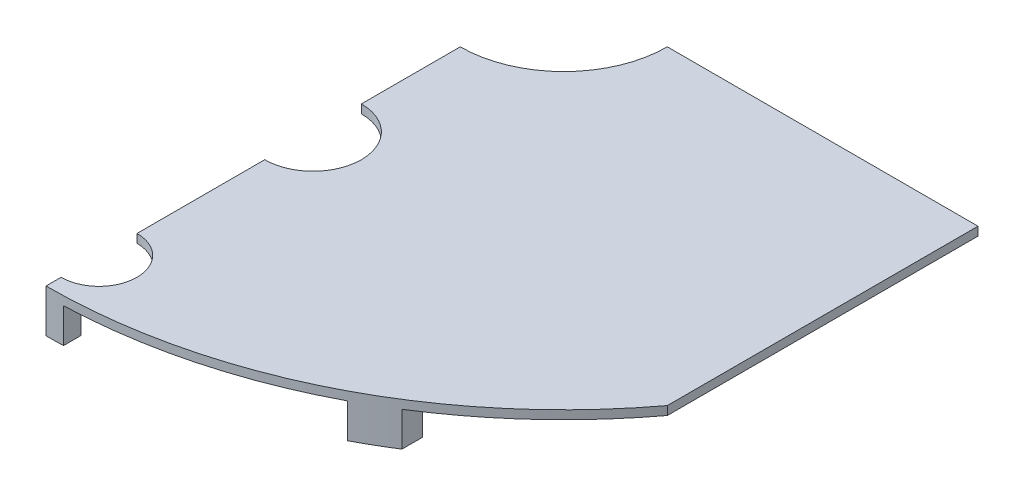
ISO-10303-21;
HEADER;
FILE_DESCRIPTION(('STEP AP214'),'2;1');
FILE_NAME('part.step','',(''),(''),'','','');
FILE_SCHEMA(('AUTOMOTIVE_DESIGN { 1 0 10303 214 1 1 1 1 }'));
ENDSEC;
DATA;
#1=APPLICATION_CONTEXT('core data for automotive mechanical design processes');
#2=APPLICATION_PROTOCOL_DEFINITION('international standard','automotive_design',2000,#1);
#3=PRODUCT_CONTEXT('',#1,'mechanical');
#4=PRODUCT('Part','Part','',(#3));
#5=PRODUCT_RELATED_PRODUCT_CATEGORY('part','',(#4));
#6=PRODUCT_DEFINITION_FORMATION('','',#4);
#7=PRODUCT_DEFINITION_CONTEXT('part definition',#1,'design');
#8=PRODUCT_DEFINITION('design','',#6,#7);
#9=PRODUCT_DEFINITION_SHAPE('','',#8);
#10=(LENGTH_UNIT() NAMED_UNIT(*) SI_UNIT(.MILLI.,.METRE.));
#11=(NAMED_UNIT(*) PLANE_ANGLE_UNIT() SI_UNIT($,.RADIAN.));
#12=(NAMED_UNIT(*) SI_UNIT($,.STERADIAN.) SOLID_ANGLE_UNIT());
#13=UNCERTAINTY_MEASURE_WITH_UNIT(LENGTH_MEASURE(1.E-05),#10,'distance_accuracy_value','');
#14=(GEOMETRIC_REPRESENTATION_CONTEXT(3) GLOBAL_UNCERTAINTY_ASSIGNED_CONTEXT((#13)) GLOBAL_UNIT_ASSIGNED_CONTEXT((#10,
#11,#12)) REPRESENTATION_CONTEXT('',''));
#15=CARTESIAN_POINT('',(0.,0.,0.));
#16=DIRECTION('',(0.,0.,1.));
#17=DIRECTION('',(1.,0.,0.));
#18=AXIS2_PLACEMENT_3D('',#15,#16,#17);
#19=CARTESIAN_POINT('',(0.,0.,0.));
#20=DIRECTION('',(0.,1.,0.));
#21=DIRECTION('',(0.,0.,1.));
#22=AXIS2_PLACEMENT_3D('',#19,#20,#21);
#23=PLANE('',#22);
#24=DIRECTION('',(1.,0.,0.));
#25=VECTOR('',#24,1.);
#26=CARTESIAN_POINT('',(0.,0.,0.));
#27=LINE('',#26,#25);
#28=CARTESIAN_POINT('',(30.,0.,0.));
#29=VERTEX_POINT('',#28);
#30=CARTESIAN_POINT('',(120.,0.,1.61653377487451E-13));
#31=VERTEX_POINT('',#30);
#32=EDGE_CURVE('E175',#29,#31,#27,.T.);
#33=ORIENTED_EDGE('',*,*,#32,.T.);
#34=DIRECTION('',(0.,0.,1.));
#35=VECTOR('',#34,1.);
#36=CARTESIAN_POINT('',(120.,0.,0.));
#37=LINE('',#36,#35);
#38=CARTESIAN_POINT('',(120.,0.,89.9999999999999));
#39=VERTEX_POINT('',#38);
#40=EDGE_CURVE('E164',#31,#39,#37,.T.);
#41=ORIENTED_EDGE('',*,*,#40,.T.);
#42=CARTESIAN_POINT('',(0.,0.,0.));
#43=DIRECTION('',(0.,1.,0.));
#44=DIRECTION('',(0.,0.,1.));
#45=AXIS2_PLACEMENT_3D('',#42,#43,#44);
#46=CIRCLE('',#45,150.);
#47=CARTESIAN_POINT('',(80.,0.,126.885775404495));
#48=VERTEX_POINT('',#47);
#49=EDGE_CURVE('E163',#48,#39,#46,.T.);
#50=ORIENTED_EDGE('',*,*,#49,.F.);
#51=DIRECTION('',(0.,0.,1.));
#52=VECTOR('',#51,1.);
#53=CARTESIAN_POINT('',(80.,0.,0.));
#54=LINE('',#53,#52);
#55=CARTESIAN_POINT('',(80.,0.,120.933866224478));
#56=VERTEX_POINT('',#55);
#57=EDGE_CURVE('E236',#56,#48,#54,.T.);
#58=ORIENTED_EDGE('',*,*,#57,.F.);
#59=CARTESIAN_POINT('',(0.,0.,0.));
#60=DIRECTION('',(0.,-1.,0.));
#61=DIRECTION('',(0.,0.,-1.));
#62=AXIS2_PLACEMENT_3D('',#59,#60,#61);
#63=CIRCLE('',#62,145.);
#64=CARTESIAN_POINT('',(70.,0.,126.984250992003));
#65=VERTEX_POINT('',#64);
#66=EDGE_CURVE('E217',#56,#65,#63,.T.);
#67=ORIENTED_EDGE('',*,*,#66,.T.);
#68=DIRECTION('',(0.,0.,1.));
#69=VECTOR('',#68,1.);
#70=CARTESIAN_POINT('',(70.,0.,0.));
#71=LINE('',#70,#69);
#72=CARTESIAN_POINT('',(70.,0.,132.664991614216));
#73=VERTEX_POINT('',#72);
#74=EDGE_CURVE('E226',#65,#73,#71,.T.);
#75=ORIENTED_EDGE('',*,*,#74,.T.);
#76=CARTESIAN_POINT('',(5.,0.,149.916643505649));
#77=VERTEX_POINT('',#76);
#78=EDGE_CURVE('E188',#77,#73,#46,.T.);
#79=ORIENTED_EDGE('',*,*,#78,.F.);
#80=DIRECTION('',(0.,0.,1.));
#81=VECTOR('',#80,1.);
#82=CARTESIAN_POINT('',(5.,0.,0.));
#83=LINE('',#82,#81);
#84=CARTESIAN_POINT('',(5.,0.,144.913767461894));
#85=VERTEX_POINT('',#84);
#86=EDGE_CURVE('E252',#85,#77,#83,.T.);
#87=ORIENTED_EDGE('',*,*,#86,.F.);
#88=CARTESIAN_POINT('',(0.,0.,0.));
#89=DIRECTION('',(0.,-1.,0.));
#90=DIRECTION('',(0.,0.,-1.));
#91=AXIS2_PLACEMENT_3D('',#88,#89,#90);
#92=CIRCLE('',#91,145.);
#93=CARTESIAN_POINT('',(3.8383223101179,0.,144.949188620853));
#94=VERTEX_POINT('',#93);
#95=EDGE_CURVE('E247',#85,#94,#92,.T.);
#96=ORIENTED_EDGE('',*,*,#95,.T.);
#97=CARTESIAN_POINT('',(0.,0.,134.640586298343));
#98=DIRECTION('',(0.,1.,0.));
#99=DIRECTION('',(0.,0.,1.));
#100=AXIS2_PLACEMENT_3D('',#97,#98,#99);
#101=CIRCLE('',#100,11.);
#102=CARTESIAN_POINT('',(0.,0.,123.640586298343));
#103=VERTEX_POINT('',#102);
#104=EDGE_CURVE('E181',#94,#103,#101,.T.);
#105=ORIENTED_EDGE('',*,*,#104,.T.);
#106=DIRECTION('',(0.,0.,-1.));
#107=VECTOR('',#106,1.);
#108=CARTESIAN_POINT('',(0.,0.,0.));
#109=LINE('',#108,#107);
#110=CARTESIAN_POINT('',(0.,0.,86.6405862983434));
#111=VERTEX_POINT('',#110);
#112=EDGE_CURVE('E284',#103,#111,#109,.T.);
#113=ORIENTED_EDGE('',*,*,#112,.T.);
#114=CARTESIAN_POINT('',(0.,0.,72.6405862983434));
#115=DIRECTION('',(0.,1.,0.));
#116=DIRECTION('',(0.,0.,1.));
#117=AXIS2_PLACEMENT_3D('',#114,#115,#116);
#118=CIRCLE('',#117,14.);
#119=CARTESIAN_POINT('',(0.,0.,58.6405862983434));
#120=VERTEX_POINT('',#119);
#121=EDGE_CURVE('E206',#111,#120,#118,.T.);
#122=ORIENTED_EDGE('',*,*,#121,.T.);
#123=CARTESIAN_POINT('',(0.,0.,30.));
#124=VERTEX_POINT('',#123);
#125=EDGE_CURVE('E282',#120,#124,#109,.T.);
#126=ORIENTED_EDGE('',*,*,#125,.T.);
#127=CARTESIAN_POINT('',(0.,0.,0.));
#128=DIRECTION('',(0.,1.,0.));
#129=DIRECTION('',(0.,0.,1.));
#130=AXIS2_PLACEMENT_3D('',#127,#128,#129);
#131=CIRCLE('',#130,30.);
#132=EDGE_CURVE('E179',#124,#29,#131,.T.);
#133=ORIENTED_EDGE('',*,*,#132,.T.);
#134=EDGE_LOOP('',(#33,#41,#50,#58,#67,#75,#79,#87,#96,#105,#113,#122,#126,#133));
#135=FACE_BOUND('',#134,.T.);
#136=ADVANCED_FACE('F35',(#135),#23,.F.);
#137=CARTESIAN_POINT('',(0.,2.5,0.));
#138=DIRECTION('',(0.,-1.,0.));
#139=DIRECTION('',(0.,0.,-1.));
#140=AXIS2_PLACEMENT_3D('',#137,#138,#139);
#141=CYLINDRICAL_SURFACE('',#140,30.);
#142=DIRECTION('',(0.,-1.,0.));
#143=VECTOR('',#142,1.);
#144=CARTESIAN_POINT('',(0.,2.5,30.));
#145=LINE('',#144,#143);
#146=CARTESIAN_POINT('',(0.,2.5,30.));
#147=VERTEX_POINT('',#146);
#148=EDGE_CURVE('E278',#147,#124,#145,.T.);
#149=ORIENTED_EDGE('',*,*,#148,.F.);
#150=CARTESIAN_POINT('',(0.,2.5,0.));
#151=DIRECTION('',(0.,1.,0.));
#152=DIRECTION('',(0.,0.,1.));
#153=AXIS2_PLACEMENT_3D('',#150,#151,#152);
#154=CIRCLE('',#153,30.);
#155=CARTESIAN_POINT('',(30.,2.5,0.));
#156=VERTEX_POINT('',#155);
#157=EDGE_CURVE('E171',#147,#156,#154,.T.);
#158=ORIENTED_EDGE('',*,*,#157,.T.);
#159=DIRECTION('',(0.,-1.,0.));
#160=VECTOR('',#159,1.);
#161=CARTESIAN_POINT('',(30.,2.5,0.));
#162=LINE('',#161,#160);
#163=EDGE_CURVE('E173',#156,#29,#162,.T.);
#164=ORIENTED_EDGE('',*,*,#163,.T.);
#165=ORIENTED_EDGE('',*,*,#132,.F.);
#166=EDGE_LOOP('',(#149,#158,#164,#165));
#167=FACE_BOUND('',#166,.T.);
#168=ADVANCED_FACE('F37',(#167),#141,.F.);
#169=CARTESIAN_POINT('',(0.,2.5,0.));
#170=DIRECTION('',(0.,-1.,0.));
#171=DIRECTION('',(0.,0.,-1.));
#172=AXIS2_PLACEMENT_3D('',#169,#170,#171);
#173=CYLINDRICAL_SURFACE('',#172,150.);
#174=ORIENTED_EDGE('',*,*,#49,.T.);
#175=DIRECTION('',(0.,1.,0.));
#176=VECTOR('',#175,1.);
#177=CARTESIAN_POINT('',(120.,-156.5,89.9999999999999));
#178=LINE('',#177,#176);
#179=CARTESIAN_POINT('',(120.,2.5,89.9999999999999));
#180=VERTEX_POINT('',#179);
#181=EDGE_CURVE('E148',#39,#180,#178,.T.);
#182=ORIENTED_EDGE('',*,*,#181,.T.);
#183=CARTESIAN_POINT('',(0.,2.5,0.));
#184=DIRECTION('',(0.,1.,0.));
#185=DIRECTION('',(0.,0.,1.));
#186=AXIS2_PLACEMENT_3D('',#183,#184,#185);
#187=CIRCLE('',#186,150.);
#188=CARTESIAN_POINT('',(0.,2.5,150.));
#189=VERTEX_POINT('',#188);
#190=EDGE_CURVE('E160',#189,#180,#187,.T.);
#191=ORIENTED_EDGE('',*,*,#190,.F.);
#192=DIRECTION('',(0.,-1.,0.));
#193=VECTOR('',#192,1.);
#194=CARTESIAN_POINT('',(0.,2.5,150.));
#195=LINE('',#194,#193);
#196=CARTESIAN_POINT('',(0.,-10.,150.));
#197=VERTEX_POINT('',#196);
#198=EDGE_CURVE('E215',#189,#197,#195,.T.);
#199=ORIENTED_EDGE('',*,*,#198,.T.);
#200=CARTESIAN_POINT('',(0.,-10.,0.));
#201=DIRECTION('',(0.,-1.,0.));
#202=DIRECTION('',(0.,0.,-1.));
#203=AXIS2_PLACEMENT_3D('',#200,#201,#202);
#204=CIRCLE('',#203,150.);
#205=CARTESIAN_POINT('',(5.,-10.,149.916643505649));
#206=VERTEX_POINT('',#205);
#207=EDGE_CURVE('E254',#206,#197,#204,.T.);
#208=ORIENTED_EDGE('',*,*,#207,.F.);
#209=DIRECTION('',(0.,1.,0.));
#210=VECTOR('',#209,1.);
#211=CARTESIAN_POINT('',(5.,-10.,149.916643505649));
#212=LINE('',#211,#210);
#213=EDGE_CURVE('E266',#206,#77,#212,.T.);
#214=ORIENTED_EDGE('',*,*,#213,.T.);
#215=ORIENTED_EDGE('',*,*,#78,.T.);
#216=DIRECTION('',(0.,1.,0.));
#217=VECTOR('',#216,1.);
#218=CARTESIAN_POINT('',(70.,-10.,132.664991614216));
#219=LINE('',#218,#217);
#220=CARTESIAN_POINT('',(70.,-10.,132.664991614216));
#221=VERTEX_POINT('',#220);
#222=EDGE_CURVE('E241',#221,#73,#219,.T.);
#223=ORIENTED_EDGE('',*,*,#222,.F.);
#224=CARTESIAN_POINT('',(0.,-10.,0.));
#225=DIRECTION('',(0.,-1.,0.));
#226=DIRECTION('',(0.,0.,-1.));
#227=AXIS2_PLACEMENT_3D('',#224,#225,#226);
#228=CIRCLE('',#227,150.);
#229=CARTESIAN_POINT('',(80.,-10.,126.885775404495));
#230=VERTEX_POINT('',#229);
#231=EDGE_CURVE('E228',#230,#221,#228,.T.);
#232=ORIENTED_EDGE('',*,*,#231,.F.);
#233=DIRECTION('',(0.,1.,0.));
#234=VECTOR('',#233,1.);
#235=CARTESIAN_POINT('',(80.,-10.,126.885775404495));
#236=LINE('',#235,#234);
#237=EDGE_CURVE('E243',#230,#48,#236,.T.);
#238=ORIENTED_EDGE('',*,*,#237,.T.);
#239=EDGE_LOOP('',(#174,#182,#191,#199,#208,#214,#215,#223,#232,#238));
#240=FACE_BOUND('',#239,.T.);
#241=ADVANCED_FACE('F158',(#240),#173,.T.);
#242=CARTESIAN_POINT('',(0.,2.5,0.));
#243=DIRECTION('',(0.,0.,-1.));
#244=DIRECTION('',(-1.,0.,0.));
#245=AXIS2_PLACEMENT_3D('',#242,#243,#244);
#246=PLANE('',#245);
#247=DIRECTION('',(0.,1.,0.));
#248=VECTOR('',#247,1.);
#249=CARTESIAN_POINT('',(120.,-156.5,1.61653377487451E-13));
#250=LINE('',#249,#248);
#251=CARTESIAN_POINT('',(120.,2.5,1.61653377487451E-13));
#252=VERTEX_POINT('',#251);
#253=EDGE_CURVE('E50',#31,#252,#250,.T.);
#254=ORIENTED_EDGE('',*,*,#253,.F.);
#255=ORIENTED_EDGE('',*,*,#32,.F.);
#256=ORIENTED_EDGE('',*,*,#163,.F.);
#257=DIRECTION('',(1.,0.,0.));
#258=VECTOR('',#257,1.);
#259=CARTESIAN_POINT('',(0.,2.5,0.));
#260=LINE('',#259,#258);
#261=EDGE_CURVE('E170',#156,#252,#260,.T.);
#262=ORIENTED_EDGE('',*,*,#261,.T.);
#263=EDGE_LOOP('',(#254,#255,#256,#262));
#264=FACE_BOUND('',#263,.T.);
#265=ADVANCED_FACE('F292',(#264),#246,.T.);
#266=CARTESIAN_POINT('',(0.,2.5,0.));
#267=DIRECTION('',(0.,1.,0.));
#268=DIRECTION('',(0.,0.,1.));
#269=AXIS2_PLACEMENT_3D('',#266,#267,#268);
#270=PLANE('',#269);
#271=DIRECTION('',(0.,0.,1.));
#272=VECTOR('',#271,1.);
#273=CARTESIAN_POINT('',(120.,2.5,0.));
#274=LINE('',#273,#272);
#275=EDGE_CURVE('E145',#252,#180,#274,.T.);
#276=ORIENTED_EDGE('',*,*,#275,.F.);
#277=ORIENTED_EDGE('',*,*,#261,.F.);
#278=ORIENTED_EDGE('',*,*,#157,.F.);
#279=DIRECTION('',(0.,0.,-1.));
#280=VECTOR('',#279,1.);
#281=CARTESIAN_POINT('',(0.,2.5,0.));
#282=LINE('',#281,#280);
#283=CARTESIAN_POINT('',(0.,2.5,58.6405862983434));
#284=VERTEX_POINT('',#283);
#285=EDGE_CURVE('E214',#284,#147,#282,.T.);
#286=ORIENTED_EDGE('',*,*,#285,.F.);
#287=CARTESIAN_POINT('',(0.,2.5,72.6405862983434));
#288=DIRECTION('',(0.,1.,0.));
#289=DIRECTION('',(0.,0.,1.));
#290=AXIS2_PLACEMENT_3D('',#287,#288,#289);
#291=CIRCLE('',#290,14.);
#292=CARTESIAN_POINT('',(0.,2.5,86.6405862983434));
#293=VERTEX_POINT('',#292);
#294=EDGE_CURVE('E204',#293,#284,#291,.T.);
#295=ORIENTED_EDGE('',*,*,#294,.F.);
#296=CARTESIAN_POINT('',(0.,2.5,123.640586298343));
#297=VERTEX_POINT('',#296);
#298=EDGE_CURVE('E211',#297,#293,#282,.T.);
#299=ORIENTED_EDGE('',*,*,#298,.F.);
#300=CARTESIAN_POINT('',(0.,2.5,134.640586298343));
#301=DIRECTION('',(0.,1.,0.));
#302=DIRECTION('',(0.,0.,1.));
#303=AXIS2_PLACEMENT_3D('',#300,#301,#302);
#304=CIRCLE('',#303,11.);
#305=CARTESIAN_POINT('',(0.,2.5,145.640586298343));
#306=VERTEX_POINT('',#305);
#307=EDGE_CURVE('E192',#306,#297,#304,.T.);
#308=ORIENTED_EDGE('',*,*,#307,.F.);
#309=EDGE_CURVE('E169',#189,#306,#282,.T.);
#310=ORIENTED_EDGE('',*,*,#309,.F.);
#311=ORIENTED_EDGE('',*,*,#190,.T.);
#312=EDGE_LOOP('',(#276,#277,#278,#286,#295,#299,#308,#310,#311));
#313=FACE_BOUND('',#312,.T.);
#314=ADVANCED_FACE('F167',(#313),#270,.T.);
#315=CARTESIAN_POINT('',(0.,-7.5,134.640586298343));
#316=DIRECTION('',(0.,1.,0.));
#317=DIRECTION('',(0.,0.,1.));
#318=AXIS2_PLACEMENT_3D('',#315,#316,#317);
#319=CYLINDRICAL_SURFACE('',#318,11.);
#320=ORIENTED_EDGE('',*,*,#307,.T.);
#321=DIRECTION('',(0.,1.,0.));
#322=VECTOR('',#321,1.);
#323=CARTESIAN_POINT('',(0.,-7.5,123.640586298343));
#324=LINE('',#323,#322);
#325=EDGE_CURVE('E274',#297,#103,#324,.F.);
#326=ORIENTED_EDGE('',*,*,#325,.T.);
#327=ORIENTED_EDGE('',*,*,#104,.F.);
#328=DIRECTION('',(0.,1.,0.));
#329=VECTOR('',#328,1.);
#330=CARTESIAN_POINT('',(3.8383223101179,-10.,144.949188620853));
#331=LINE('',#330,#329);
#332=CARTESIAN_POINT('',(3.8383223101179,-10.,144.949188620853));
#333=VERTEX_POINT('',#332);
#334=EDGE_CURVE('E259',#333,#94,#331,.T.);
#335=ORIENTED_EDGE('',*,*,#334,.F.);
#336=CARTESIAN_POINT('',(0.,-10.,134.640586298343));
#337=DIRECTION('',(0.,-1.,0.));
#338=DIRECTION('',(0.,0.,-1.));
#339=AXIS2_PLACEMENT_3D('',#336,#337,#338);
#340=CIRCLE('',#339,11.);
#341=CARTESIAN_POINT('',(0.,-10.,145.640586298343));
#342=VERTEX_POINT('',#341);
#343=EDGE_CURVE('E257',#342,#333,#340,.F.);
#344=ORIENTED_EDGE('',*,*,#343,.F.);
#345=DIRECTION('',(0.,1.,0.));
#346=VECTOR('',#345,1.);
#347=CARTESIAN_POINT('',(0.,-7.5,145.640586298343));
#348=LINE('',#347,#346);
#349=EDGE_CURVE('E58',#342,#306,#348,.T.);
#350=ORIENTED_EDGE('',*,*,#349,.T.);
#351=EDGE_LOOP('',(#320,#326,#327,#335,#344,#350));
#352=FACE_BOUND('',#351,.T.);
#353=ADVANCED_FACE('F273',(#352),#319,.F.);
#354=CARTESIAN_POINT('',(0.,-10.,0.));
#355=DIRECTION('',(0.,1.,0.));
#356=DIRECTION('',(0.,0.,1.));
#357=AXIS2_PLACEMENT_3D('',#354,#355,#356);
#358=CYLINDRICAL_SURFACE('',#357,145.);
#359=ORIENTED_EDGE('',*,*,#95,.F.);
#360=DIRECTION('',(0.,1.,0.));
#361=VECTOR('',#360,1.);
#362=CARTESIAN_POINT('',(5.,-10.,144.913767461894));
#363=LINE('',#362,#361);
#364=CARTESIAN_POINT('',(5.,-10.,144.913767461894));
#365=VERTEX_POINT('',#364);
#366=EDGE_CURVE('E269',#365,#85,#363,.T.);
#367=ORIENTED_EDGE('',*,*,#366,.F.);
#368=CARTESIAN_POINT('',(0.,-10.,0.));
#369=DIRECTION('',(0.,-1.,0.));
#370=DIRECTION('',(0.,0.,-1.));
#371=AXIS2_PLACEMENT_3D('',#368,#369,#370);
#372=CIRCLE('',#371,145.);
#373=EDGE_CURVE('E248',#365,#333,#372,.T.);
#374=ORIENTED_EDGE('',*,*,#373,.T.);
#375=ORIENTED_EDGE('',*,*,#334,.T.);
#376=EDGE_LOOP('',(#359,#367,#374,#375));
#377=FACE_BOUND('',#376,.T.);
#378=ADVANCED_FACE('F361',(#377),#358,.F.);
#379=CARTESIAN_POINT('',(5.,-10.,0.));
#380=DIRECTION('',(-1.,0.,0.));
#381=DIRECTION('',(0.,0.,1.));
#382=AXIS2_PLACEMENT_3D('',#379,#380,#381);
#383=PLANE('',#382);
#384=ORIENTED_EDGE('',*,*,#86,.T.);
#385=ORIENTED_EDGE('',*,*,#213,.F.);
#386=DIRECTION('',(0.,0.,1.));
#387=VECTOR('',#386,1.);
#388=CARTESIAN_POINT('',(5.,-10.,0.));
#389=LINE('',#388,#387);
#390=EDGE_CURVE('E251',#365,#206,#389,.T.);
#391=ORIENTED_EDGE('',*,*,#390,.F.);
#392=ORIENTED_EDGE('',*,*,#366,.T.);
#393=EDGE_LOOP('',(#384,#385,#391,#392));
#394=FACE_BOUND('',#393,.T.);
#395=ADVANCED_FACE('F306',(#394),#383,.F.);
#396=CARTESIAN_POINT('',(0.,-10.,0.));
#397=DIRECTION('',(0.,-1.,0.));
#398=DIRECTION('',(0.,0.,-1.));
#399=AXIS2_PLACEMENT_3D('',#396,#397,#398);
#400=PLANE('',#399);
#401=DIRECTION('',(0.,0.,1.));
#402=VECTOR('',#401,1.);
#403=CARTESIAN_POINT('',(0.,-10.,0.));
#404=LINE('',#403,#402);
#405=EDGE_CURVE('E277',#342,#197,#404,.T.);
#406=ORIENTED_EDGE('',*,*,#405,.F.);
#407=ORIENTED_EDGE('',*,*,#343,.T.);
#408=ORIENTED_EDGE('',*,*,#373,.F.);
#409=ORIENTED_EDGE('',*,*,#390,.T.);
#410=ORIENTED_EDGE('',*,*,#207,.T.);
#411=EDGE_LOOP('',(#406,#407,#408,#409,#410));
#412=FACE_BOUND('',#411,.T.);
#413=ADVANCED_FACE('F301',(#412),#400,.T.);
#414=CARTESIAN_POINT('',(0.,-10.,0.));
#415=DIRECTION('',(0.,1.,0.));
#416=DIRECTION('',(0.,0.,1.));
#417=AXIS2_PLACEMENT_3D('',#414,#415,#416);
#418=CYLINDRICAL_SURFACE('',#417,145.);
#419=ORIENTED_EDGE('',*,*,#66,.F.);
#420=DIRECTION('',(0.,1.,0.));
#421=VECTOR('',#420,1.);
#422=CARTESIAN_POINT('',(80.,-10.,120.933866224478));
#423=LINE('',#422,#421);
#424=CARTESIAN_POINT('',(80.,-10.,120.933866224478));
#425=VERTEX_POINT('',#424);
#426=EDGE_CURVE('E245',#425,#56,#423,.T.);
#427=ORIENTED_EDGE('',*,*,#426,.F.);
#428=CARTESIAN_POINT('',(0.,-10.,0.));
#429=DIRECTION('',(0.,-1.,0.));
#430=DIRECTION('',(0.,0.,-1.));
#431=AXIS2_PLACEMENT_3D('',#428,#429,#430);
#432=CIRCLE('',#431,145.);
#433=CARTESIAN_POINT('',(70.,-10.,126.984250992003));
#434=VERTEX_POINT('',#433);
#435=EDGE_CURVE('E222',#425,#434,#432,.T.);
#436=ORIENTED_EDGE('',*,*,#435,.T.);
#437=DIRECTION('',(0.,1.,0.));
#438=VECTOR('',#437,1.);
#439=CARTESIAN_POINT('',(70.,-10.,126.984250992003));
#440=LINE('',#439,#438);
#441=EDGE_CURVE('E233',#434,#65,#440,.T.);
#442=ORIENTED_EDGE('',*,*,#441,.T.);
#443=EDGE_LOOP('',(#419,#427,#436,#442));
#444=FACE_BOUND('',#443,.T.);
#445=ADVANCED_FACE('F322',(#444),#418,.F.);
#446=CARTESIAN_POINT('',(80.,-10.,0.));
#447=DIRECTION('',(-1.,0.,0.));
#448=DIRECTION('',(0.,0.,1.));
#449=AXIS2_PLACEMENT_3D('',#446,#447,#448);
#450=PLANE('',#449);
#451=ORIENTED_EDGE('',*,*,#57,.T.);
#452=ORIENTED_EDGE('',*,*,#237,.F.);
#453=DIRECTION('',(0.,0.,1.));
#454=VECTOR('',#453,1.);
#455=CARTESIAN_POINT('',(80.,-10.,0.));
#456=LINE('',#455,#454);
#457=EDGE_CURVE('E225',#425,#230,#456,.T.);
#458=ORIENTED_EDGE('',*,*,#457,.F.);
#459=ORIENTED_EDGE('',*,*,#426,.T.);
#460=EDGE_LOOP('',(#451,#452,#458,#459));
#461=FACE_BOUND('',#460,.T.);
#462=ADVANCED_FACE('F320',(#461),#450,.F.);
#463=CARTESIAN_POINT('',(70.,-10.,0.));
#464=DIRECTION('',(-1.,0.,0.));
#465=DIRECTION('',(0.,0.,1.));
#466=AXIS2_PLACEMENT_3D('',#463,#464,#465);
#467=PLANE('',#466);
#468=ORIENTED_EDGE('',*,*,#74,.F.);
#469=ORIENTED_EDGE('',*,*,#441,.F.);
#470=DIRECTION('',(0.,0.,1.));
#471=VECTOR('',#470,1.);
#472=CARTESIAN_POINT('',(70.,-10.,0.));
#473=LINE('',#472,#471);
#474=EDGE_CURVE('E230',#434,#221,#473,.T.);
#475=ORIENTED_EDGE('',*,*,#474,.T.);
#476=ORIENTED_EDGE('',*,*,#222,.T.);
#477=EDGE_LOOP('',(#468,#469,#475,#476));
#478=FACE_BOUND('',#477,.T.);
#479=ADVANCED_FACE('F312',(#478),#467,.T.);
#480=CARTESIAN_POINT('',(0.,-10.,0.));
#481=DIRECTION('',(0.,-1.,0.));
#482=DIRECTION('',(0.,0.,-1.));
#483=AXIS2_PLACEMENT_3D('',#480,#481,#482);
#484=PLANE('',#483);
#485=ORIENTED_EDGE('',*,*,#435,.F.);
#486=ORIENTED_EDGE('',*,*,#457,.T.);
#487=ORIENTED_EDGE('',*,*,#231,.T.);
#488=ORIENTED_EDGE('',*,*,#474,.F.);
#489=EDGE_LOOP('',(#485,#486,#487,#488));
#490=FACE_BOUND('',#489,.T.);
#491=ADVANCED_FACE('F316',(#490),#484,.T.);
#492=CARTESIAN_POINT('',(0.,-7.5,72.6405862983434));
#493=DIRECTION('',(0.,1.,0.));
#494=DIRECTION('',(0.,0.,1.));
#495=AXIS2_PLACEMENT_3D('',#492,#493,#494);
#496=CYLINDRICAL_SURFACE('',#495,14.);
#497=ORIENTED_EDGE('',*,*,#294,.T.);
#498=DIRECTION('',(0.,1.,0.));
#499=VECTOR('',#498,1.);
#500=CARTESIAN_POINT('',(0.,-7.5,58.6405862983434));
#501=LINE('',#500,#499);
#502=EDGE_CURVE('E11',#284,#120,#501,.F.);
#503=ORIENTED_EDGE('',*,*,#502,.T.);
#504=ORIENTED_EDGE('',*,*,#121,.F.);
#505=DIRECTION('',(0.,1.,0.));
#506=VECTOR('',#505,1.);
#507=CARTESIAN_POINT('',(0.,-7.5,86.6405862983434));
#508=LINE('',#507,#506);
#509=EDGE_CURVE('E43',#111,#293,#508,.T.);
#510=ORIENTED_EDGE('',*,*,#509,.T.);
#511=EDGE_LOOP('',(#497,#503,#504,#510));
#512=FACE_BOUND('',#511,.T.);
#513=ADVANCED_FACE('F203',(#512),#496,.F.);
#514=CARTESIAN_POINT('',(0.,-156.5,0.));
#515=DIRECTION('',(1.,0.,0.));
#516=DIRECTION('',(0.,0.,-1.));
#517=AXIS2_PLACEMENT_3D('',#514,#515,#516);
#518=PLANE('',#517);
#519=ORIENTED_EDGE('',*,*,#298,.T.);
#520=ORIENTED_EDGE('',*,*,#509,.F.);
#521=ORIENTED_EDGE('',*,*,#112,.F.);
#522=ORIENTED_EDGE('',*,*,#325,.F.);
#523=EDGE_LOOP('',(#519,#520,#521,#522));
#524=FACE_BOUND('',#523,.T.);
#525=ADVANCED_FACE('F297',(#524),#518,.F.);
#526=ORIENTED_EDGE('',*,*,#148,.T.);
#527=ORIENTED_EDGE('',*,*,#125,.F.);
#528=ORIENTED_EDGE('',*,*,#502,.F.);
#529=ORIENTED_EDGE('',*,*,#285,.T.);
#530=EDGE_LOOP('',(#526,#527,#528,#529));
#531=FACE_BOUND('',#530,.T.);
#532=ADVANCED_FACE('F296',(#531),#518,.F.);
#533=ORIENTED_EDGE('',*,*,#309,.T.);
#534=ORIENTED_EDGE('',*,*,#349,.F.);
#535=ORIENTED_EDGE('',*,*,#405,.T.);
#536=ORIENTED_EDGE('',*,*,#198,.F.);
#537=EDGE_LOOP('',(#533,#534,#535,#536));
#538=FACE_BOUND('',#537,.T.);
#539=ADVANCED_FACE('F298',(#538),#518,.F.);
#540=CARTESIAN_POINT('',(120.,-156.5,0.));
#541=DIRECTION('',(-1.,0.,0.));
#542=DIRECTION('',(0.,0.,1.));
#543=AXIS2_PLACEMENT_3D('',#540,#541,#542);
#544=PLANE('',#543);
#545=ORIENTED_EDGE('',*,*,#253,.T.);
#546=ORIENTED_EDGE('',*,*,#275,.T.);
#547=ORIENTED_EDGE('',*,*,#181,.F.);
#548=ORIENTED_EDGE('',*,*,#40,.F.);
#549=EDGE_LOOP('',(#545,#546,#547,#548));
#550=FACE_BOUND('',#549,.T.);
#551=ADVANCED_FACE('F147',(#550),#544,.F.);
#552=CLOSED_SHELL('',(#136,#168,#241,#265,#314,#353,#378,#395,#413,#445,#462,#479,#491,#513,
#525,#532,#539,#551));
#553=MANIFOLD_SOLID_BREP('B2',#552);
#554=ADVANCED_BREP_SHAPE_REPRESENTATION('',(#18,#553),#14);
#555=SHAPE_DEFINITION_REPRESENTATION(#9,#554);
ENDSEC;
END-ISO-10303-21;
